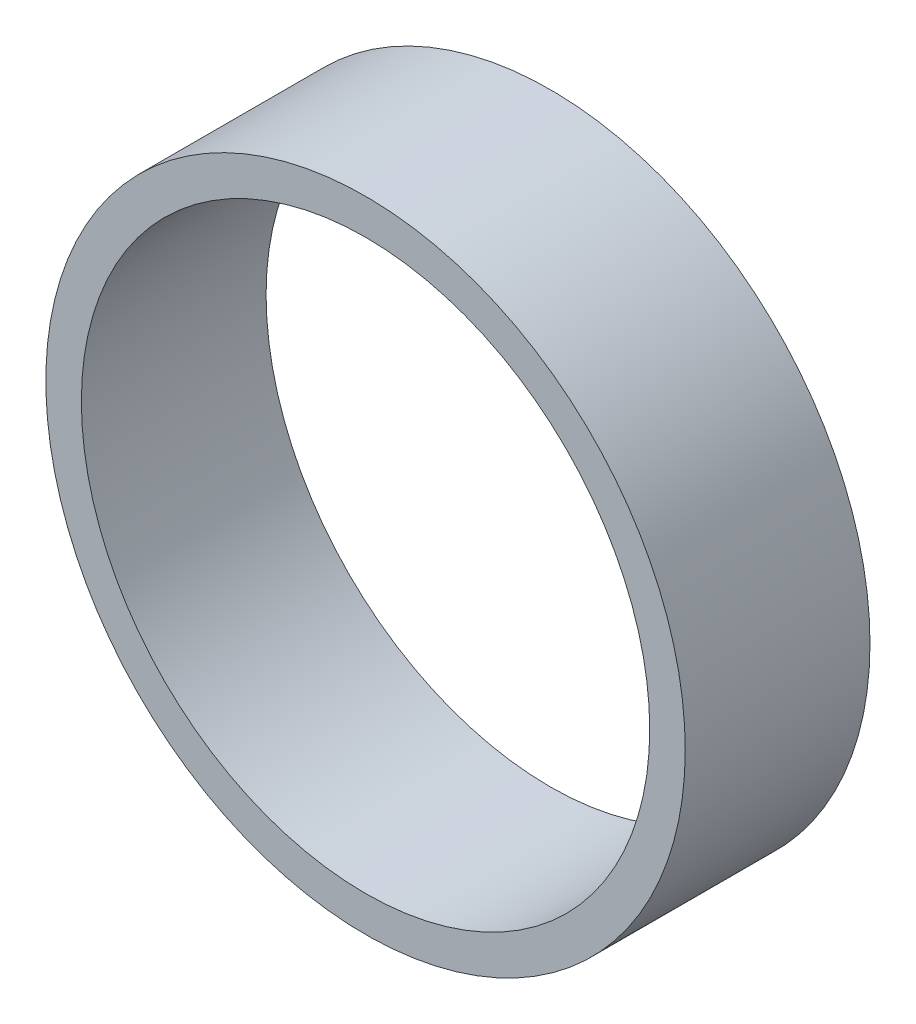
ISO-10303-21;
HEADER;
FILE_DESCRIPTION(('STEP AP214'),'2;1');
FILE_NAME('part.step','',(''),(''),'','','');
FILE_SCHEMA(('AUTOMOTIVE_DESIGN { 1 0 10303 214 1 1 1 1 }'));
ENDSEC;
DATA;
#1=APPLICATION_CONTEXT('core data for automotive mechanical design processes');
#2=APPLICATION_PROTOCOL_DEFINITION('international standard','automotive_design',2000,#1);
#3=PRODUCT_CONTEXT('',#1,'mechanical');
#4=PRODUCT('Part','Part','',(#3));
#5=PRODUCT_RELATED_PRODUCT_CATEGORY('part','',(#4));
#6=PRODUCT_DEFINITION_FORMATION('','',#4);
#7=PRODUCT_DEFINITION_CONTEXT('part definition',#1,'design');
#8=PRODUCT_DEFINITION('design','',#6,#7);
#9=PRODUCT_DEFINITION_SHAPE('','',#8);
#10=(LENGTH_UNIT() NAMED_UNIT(*) SI_UNIT(.MILLI.,.METRE.));
#11=(NAMED_UNIT(*) PLANE_ANGLE_UNIT() SI_UNIT($,.RADIAN.));
#12=(NAMED_UNIT(*) SI_UNIT($,.STERADIAN.) SOLID_ANGLE_UNIT());
#13=UNCERTAINTY_MEASURE_WITH_UNIT(LENGTH_MEASURE(1.E-05),#10,'distance_accuracy_value','');
#14=(GEOMETRIC_REPRESENTATION_CONTEXT(3) GLOBAL_UNCERTAINTY_ASSIGNED_CONTEXT((#13)) GLOBAL_UNIT_ASSIGNED_CONTEXT((#10,
#11,#12)) REPRESENTATION_CONTEXT('',''));
#15=CARTESIAN_POINT('',(0.,0.,0.));
#16=DIRECTION('',(0.,0.,1.));
#17=DIRECTION('',(1.,0.,0.));
#18=AXIS2_PLACEMENT_3D('',#15,#16,#17);
#19=CARTESIAN_POINT('',(-2.22044604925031E-13,0.,-12.9999999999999));
#20=DIRECTION('',(0.,0.,1.));
#21=DIRECTION('',(1.00000000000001,0.,0.));
#22=AXIS2_PLACEMENT_3D('',#19,#20,#21);
#23=CYLINDRICAL_SURFACE('',#22,22.5);
#24=CARTESIAN_POINT('',(-2.22044604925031E-13,0.,-12.9999999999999));
#25=DIRECTION('',(0.,0.,1.));
#26=DIRECTION('',(1.00000000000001,0.,0.));
#27=AXIS2_PLACEMENT_3D('',#24,#25,#26);
#28=CIRCLE('',#27,22.5);
#29=CARTESIAN_POINT('',(22.5,0.,-12.9999999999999));
#30=VERTEX_POINT('',#29);
#31=EDGE_CURVE('E11',#30,#30,#28,.T.);
#32=CARTESIAN_POINT('',(-2.77555756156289E-13,0.,1.2490009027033E-13));
#33=DIRECTION('',(0.,0.,1.));
#34=DIRECTION('',(1.00000000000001,0.,0.));
#35=AXIS2_PLACEMENT_3D('',#32,#33,#34);
#36=CIRCLE('',#35,22.5);
#37=CARTESIAN_POINT('',(22.5,0.,1.26634813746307E-13));
#38=VERTEX_POINT('',#37);
#39=EDGE_CURVE('E49',#38,#38,#36,.T.);
#40=CARTESIAN_POINT('',(22.5,0.,-12.9999999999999));
#41=CARTESIAN_POINT('',(22.5,0.,-12.8645833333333));
#42=CARTESIAN_POINT('',(22.5,0.,-12.7291666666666));
#43=CARTESIAN_POINT('',(22.5,0.,-12.4583333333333));
#44=CARTESIAN_POINT('',(22.5,0.,-12.3229166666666));
#45=CARTESIAN_POINT('',(22.5,0.,-12.0520833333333));
#46=CARTESIAN_POINT('',(22.5,0.,-11.9166666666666));
#47=CARTESIAN_POINT('',(22.5,0.,-11.6458333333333));
#48=CARTESIAN_POINT('',(22.5,0.,-11.5104166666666));
#49=CARTESIAN_POINT('',(22.5,0.,-11.2395833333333));
#50=CARTESIAN_POINT('',(22.5,0.,-11.1041666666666));
#51=CARTESIAN_POINT('',(22.5,0.,-10.8333333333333));
#52=CARTESIAN_POINT('',(22.5,0.,-10.6979166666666));
#53=CARTESIAN_POINT('',(22.5,0.,-10.4270833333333));
#54=CARTESIAN_POINT('',(22.5,0.,-10.2916666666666));
#55=CARTESIAN_POINT('',(22.5,0.,-10.0208333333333));
#56=CARTESIAN_POINT('',(22.5,0.,-9.88541666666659));
#57=CARTESIAN_POINT('',(22.5,0.,-9.61458333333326));
#58=CARTESIAN_POINT('',(22.5,0.,-9.47916666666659));
#59=CARTESIAN_POINT('',(22.5,0.,-9.20833333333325));
#60=CARTESIAN_POINT('',(22.5,0.,-9.07291666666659));
#61=CARTESIAN_POINT('',(22.5,0.,-8.80208333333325));
#62=CARTESIAN_POINT('',(22.5,0.,-8.66666666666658));
#63=CARTESIAN_POINT('',(22.5,0.,-8.39583333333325));
#64=CARTESIAN_POINT('',(22.5,0.,-8.26041666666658));
#65=CARTESIAN_POINT('',(22.5,0.,-7.98958333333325));
#66=CARTESIAN_POINT('',(22.5,0.,-7.85416666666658));
#67=CARTESIAN_POINT('',(22.5,0.,-7.58333333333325));
#68=CARTESIAN_POINT('',(22.5,0.,-7.44791666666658));
#69=CARTESIAN_POINT('',(22.5,0.,-7.17708333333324));
#70=CARTESIAN_POINT('',(22.5,0.,-7.04166666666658));
#71=CARTESIAN_POINT('',(22.5,0.,-6.77083333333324));
#72=CARTESIAN_POINT('',(22.5,0.,-6.63541666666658));
#73=CARTESIAN_POINT('',(22.5,0.,-6.36458333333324));
#74=CARTESIAN_POINT('',(22.5,0.,-6.22916666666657));
#75=CARTESIAN_POINT('',(22.5,0.,-5.95833333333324));
#76=CARTESIAN_POINT('',(22.5,0.,-5.82291666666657));
#77=CARTESIAN_POINT('',(22.5,0.,-5.55208333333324));
#78=CARTESIAN_POINT('',(22.5,0.,-5.41666666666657));
#79=CARTESIAN_POINT('',(22.5,0.,-5.14583333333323));
#80=CARTESIAN_POINT('',(22.5,0.,-5.01041666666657));
#81=CARTESIAN_POINT('',(22.5,0.,-4.73958333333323));
#82=CARTESIAN_POINT('',(22.5,0.,-4.60416666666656));
#83=CARTESIAN_POINT('',(22.5,0.,-4.33333333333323));
#84=CARTESIAN_POINT('',(22.5,0.,-4.19791666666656));
#85=CARTESIAN_POINT('',(22.5,0.,-3.92708333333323));
#86=CARTESIAN_POINT('',(22.5,0.,-3.79166666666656));
#87=CARTESIAN_POINT('',(22.5,0.,-3.52083333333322));
#88=CARTESIAN_POINT('',(22.5,0.,-3.38541666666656));
#89=CARTESIAN_POINT('',(22.5,0.,-3.11458333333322));
#90=CARTESIAN_POINT('',(22.5,0.,-2.97916666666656));
#91=CARTESIAN_POINT('',(22.5,0.,-2.70833333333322));
#92=CARTESIAN_POINT('',(22.5,0.,-2.57291666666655));
#93=CARTESIAN_POINT('',(22.5,0.,-2.30208333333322));
#94=CARTESIAN_POINT('',(22.5,0.,-2.16666666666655));
#95=CARTESIAN_POINT('',(22.5,0.,-1.89583333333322));
#96=CARTESIAN_POINT('',(22.5,0.,-1.76041666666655));
#97=CARTESIAN_POINT('',(22.5,0.,-1.48958333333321));
#98=CARTESIAN_POINT('',(22.5,0.,-1.35416666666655));
#99=CARTESIAN_POINT('',(22.5,0.,-1.08333333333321));
#100=CARTESIAN_POINT('',(22.5,0.,-0.947916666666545));
#101=CARTESIAN_POINT('',(22.5,0.,-0.67708333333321));
#102=CARTESIAN_POINT('',(22.5,0.,-0.541666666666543));
#103=CARTESIAN_POINT('',(22.5,0.,-0.270833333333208));
#104=CARTESIAN_POINT('',(22.5,0.,-0.135416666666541));
#105=CARTESIAN_POINT('',(22.5,0.,1.26634813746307E-13));
#106=B_SPLINE_CURVE_WITH_KNOTS('',3,(#40,#41,#42,#43,#44,#45,#46,#47,#48,#49,#50,#51,#52,#53,
#54,#55,#56,#57,#58,#59,#60,#61,#62,#63,#64,#65,#66,#67,#68,#69,#70,#71,#72,#73,#74,#75,#76,#77,
#78,#79,#80,#81,#82,#83,#84,#85,#86,#87,#88,#89,#90,#91,#92,#93,#94,#95,#96,#97,#98,#99,#100,
#101,#102,#103,#104,#105),.UNSPECIFIED.,.F.,.F.,(4,2,2,2,2,2,2,2,2,2,2,2,2,2,2,2,2,2,2,2,2,2,2,
2,2,2,2,2,2,2,2,2,4),(0.,0.406250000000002,0.812500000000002,1.21875000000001,1.62500000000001,
2.03125000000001,2.43750000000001,2.84375000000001,3.25000000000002,3.65625000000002,
4.06250000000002,4.46875000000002,4.87500000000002,5.28125000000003,5.68750000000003,
6.09375000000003,6.50000000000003,6.90625000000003,7.31250000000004,7.71875000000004,
8.12500000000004,8.53125000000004,8.93750000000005,9.34375000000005,9.75000000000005,
10.1562500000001,10.5625000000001,10.9687500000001,11.3750000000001,11.7812500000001,
12.1875000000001,12.5937500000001,13.0000000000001),.UNSPECIFIED.);
#107=EDGE_CURVE('BSEAM42',#30,#38,#106,.T.);
#108=ORIENTED_EDGE('',*,*,#31,.T.);
#109=ORIENTED_EDGE('',*,*,#39,.F.);
#110=ORIENTED_EDGE('',*,*,#107,.T.);
#111=ORIENTED_EDGE('',*,*,#107,.F.);
#112=EDGE_LOOP('',(#108,#110,#109,#111));
#113=FACE_BOUND('',#112,.T.);
#114=ADVANCED_FACE('F42',(#113),#23,.T.);
#115=CARTESIAN_POINT('',(-2.22044604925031E-13,0.,-12.9999999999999));
#116=DIRECTION('',(0.,0.,1.));
#117=DIRECTION('',(1.00000000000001,0.,0.));
#118=AXIS2_PLACEMENT_3D('',#115,#116,#117);
#119=PLANE('',#118);
#120=CARTESIAN_POINT('',(-2.22044604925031E-13,0.,-12.9999999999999));
#121=DIRECTION('',(0.,0.,1.));
#122=DIRECTION('',(1.00000000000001,0.,0.));
#123=AXIS2_PLACEMENT_3D('',#120,#121,#122);
#124=CIRCLE('',#123,20.);
#125=CARTESIAN_POINT('',(20.,0.,-12.9999999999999));
#126=VERTEX_POINT('',#125);
#127=EDGE_CURVE('E55',#126,#126,#124,.T.);
#128=ORIENTED_EDGE('',*,*,#127,.T.);
#129=EDGE_LOOP('',(#128));
#130=FACE_BOUND('',#129,.T.);
#131=ORIENTED_EDGE('',*,*,#31,.F.);
#132=EDGE_LOOP('',(#131));
#133=FACE_BOUND('',#132,.T.);
#134=ADVANCED_FACE('F70',(#130,#133),#119,.F.);
#135=CARTESIAN_POINT('',(-2.77555756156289E-13,0.,1.2490009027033E-13));
#136=DIRECTION('',(0.,0.,1.));
#137=DIRECTION('',(1.00000000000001,0.,0.));
#138=AXIS2_PLACEMENT_3D('',#135,#136,#137);
#139=PLANE('',#138);
#140=CARTESIAN_POINT('',(-2.77555756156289E-13,0.,1.2490009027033E-13));
#141=DIRECTION('',(0.,0.,1.));
#142=DIRECTION('',(1.00000000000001,0.,0.));
#143=AXIS2_PLACEMENT_3D('',#140,#141,#142);
#144=CIRCLE('',#143,20.);
#145=CARTESIAN_POINT('',(20.,0.,1.26634813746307E-13));
#146=VERTEX_POINT('',#145);
#147=EDGE_CURVE('E60',#146,#146,#144,.T.);
#148=ORIENTED_EDGE('',*,*,#147,.F.);
#149=EDGE_LOOP('',(#148));
#150=FACE_BOUND('',#149,.T.);
#151=ORIENTED_EDGE('',*,*,#39,.T.);
#152=EDGE_LOOP('',(#151));
#153=FACE_BOUND('',#152,.T.);
#154=ADVANCED_FACE('F68',(#150,#153),#139,.T.);
#155=CARTESIAN_POINT('',(-2.22044604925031E-13,0.,-12.9999999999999));
#156=DIRECTION('',(0.,0.,1.));
#157=DIRECTION('',(1.00000000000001,0.,0.));
#158=AXIS2_PLACEMENT_3D('',#155,#156,#157);
#159=CYLINDRICAL_SURFACE('',#158,20.);
#160=CARTESIAN_POINT('',(20.,0.,-12.9999999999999));
#161=CARTESIAN_POINT('',(20.,0.,-12.8645833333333));
#162=CARTESIAN_POINT('',(20.,0.,-12.7291666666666));
#163=CARTESIAN_POINT('',(20.,0.,-12.4583333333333));
#164=CARTESIAN_POINT('',(20.,0.,-12.3229166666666));
#165=CARTESIAN_POINT('',(20.,0.,-12.0520833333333));
#166=CARTESIAN_POINT('',(20.,0.,-11.9166666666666));
#167=CARTESIAN_POINT('',(20.,0.,-11.6458333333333));
#168=CARTESIAN_POINT('',(20.,0.,-11.5104166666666));
#169=CARTESIAN_POINT('',(20.,0.,-11.2395833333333));
#170=CARTESIAN_POINT('',(20.,0.,-11.1041666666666));
#171=CARTESIAN_POINT('',(20.,0.,-10.8333333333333));
#172=CARTESIAN_POINT('',(20.,0.,-10.6979166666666));
#173=CARTESIAN_POINT('',(20.,0.,-10.4270833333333));
#174=CARTESIAN_POINT('',(20.,0.,-10.2916666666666));
#175=CARTESIAN_POINT('',(20.,0.,-10.0208333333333));
#176=CARTESIAN_POINT('',(20.,0.,-9.88541666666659));
#177=CARTESIAN_POINT('',(20.,0.,-9.61458333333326));
#178=CARTESIAN_POINT('',(20.,0.,-9.47916666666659));
#179=CARTESIAN_POINT('',(20.,0.,-9.20833333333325));
#180=CARTESIAN_POINT('',(20.,0.,-9.07291666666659));
#181=CARTESIAN_POINT('',(20.,0.,-8.80208333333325));
#182=CARTESIAN_POINT('',(20.,0.,-8.66666666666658));
#183=CARTESIAN_POINT('',(20.,0.,-8.39583333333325));
#184=CARTESIAN_POINT('',(20.,0.,-8.26041666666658));
#185=CARTESIAN_POINT('',(20.,0.,-7.98958333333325));
#186=CARTESIAN_POINT('',(20.,0.,-7.85416666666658));
#187=CARTESIAN_POINT('',(20.,0.,-7.58333333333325));
#188=CARTESIAN_POINT('',(20.,0.,-7.44791666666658));
#189=CARTESIAN_POINT('',(20.,0.,-7.17708333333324));
#190=CARTESIAN_POINT('',(20.,0.,-7.04166666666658));
#191=CARTESIAN_POINT('',(20.,0.,-6.77083333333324));
#192=CARTESIAN_POINT('',(20.,0.,-6.63541666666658));
#193=CARTESIAN_POINT('',(20.,0.,-6.36458333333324));
#194=CARTESIAN_POINT('',(20.,0.,-6.22916666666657));
#195=CARTESIAN_POINT('',(20.,0.,-5.95833333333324));
#196=CARTESIAN_POINT('',(20.,0.,-5.82291666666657));
#197=CARTESIAN_POINT('',(20.,0.,-5.55208333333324));
#198=CARTESIAN_POINT('',(20.,0.,-5.41666666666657));
#199=CARTESIAN_POINT('',(20.,0.,-5.14583333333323));
#200=CARTESIAN_POINT('',(20.,0.,-5.01041666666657));
#201=CARTESIAN_POINT('',(20.,0.,-4.73958333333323));
#202=CARTESIAN_POINT('',(20.,0.,-4.60416666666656));
#203=CARTESIAN_POINT('',(20.,0.,-4.33333333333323));
#204=CARTESIAN_POINT('',(20.,0.,-4.19791666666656));
#205=CARTESIAN_POINT('',(20.,0.,-3.92708333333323));
#206=CARTESIAN_POINT('',(20.,0.,-3.79166666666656));
#207=CARTESIAN_POINT('',(20.,0.,-3.52083333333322));
#208=CARTESIAN_POINT('',(20.,0.,-3.38541666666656));
#209=CARTESIAN_POINT('',(20.,0.,-3.11458333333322));
#210=CARTESIAN_POINT('',(20.,0.,-2.97916666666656));
#211=CARTESIAN_POINT('',(20.,0.,-2.70833333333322));
#212=CARTESIAN_POINT('',(20.,0.,-2.57291666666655));
#213=CARTESIAN_POINT('',(20.,0.,-2.30208333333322));
#214=CARTESIAN_POINT('',(20.,0.,-2.16666666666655));
#215=CARTESIAN_POINT('',(20.,0.,-1.89583333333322));
#216=CARTESIAN_POINT('',(20.,0.,-1.76041666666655));
#217=CARTESIAN_POINT('',(20.,0.,-1.48958333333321));
#218=CARTESIAN_POINT('',(20.,0.,-1.35416666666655));
#219=CARTESIAN_POINT('',(20.,0.,-1.08333333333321));
#220=CARTESIAN_POINT('',(20.,0.,-0.947916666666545));
#221=CARTESIAN_POINT('',(20.,0.,-0.67708333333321));
#222=CARTESIAN_POINT('',(20.,0.,-0.541666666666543));
#223=CARTESIAN_POINT('',(20.,0.,-0.270833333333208));
#224=CARTESIAN_POINT('',(20.,0.,-0.135416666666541));
#225=CARTESIAN_POINT('',(20.,0.,1.26634813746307E-13));
#226=B_SPLINE_CURVE_WITH_KNOTS('',3,(#160,#161,#162,#163,#164,#165,#166,#167,#168,#169,#170,
#171,#172,#173,#174,#175,#176,#177,#178,#179,#180,#181,#182,#183,#184,#185,#186,#187,#188,#189,
#190,#191,#192,#193,#194,#195,#196,#197,#198,#199,#200,#201,#202,#203,#204,#205,#206,#207,#208,
#209,#210,#211,#212,#213,#214,#215,#216,#217,#218,#219,#220,#221,#222,#223,#224,#225),
.UNSPECIFIED.,.F.,.F.,(4,2,2,2,2,2,2,2,2,2,2,2,2,2,2,2,2,2,2,2,2,2,2,2,2,2,2,2,2,2,2,2,4),(0.,
0.406250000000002,0.812500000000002,1.21875000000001,1.62500000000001,2.03125000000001,
2.43750000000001,2.84375000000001,3.25000000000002,3.65625000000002,4.06250000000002,
4.46875000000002,4.87500000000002,5.28125000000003,5.68750000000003,6.09375000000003,
6.50000000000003,6.90625000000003,7.31250000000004,7.71875000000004,8.12500000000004,
8.53125000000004,8.93750000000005,9.34375000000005,9.75000000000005,10.1562500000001,
10.5625000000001,10.9687500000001,11.3750000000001,11.7812500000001,12.1875000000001,
12.5937500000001,13.0000000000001),.UNSPECIFIED.);
#227=EDGE_CURVE('BSEAM66',#126,#146,#226,.T.);
#228=ORIENTED_EDGE('',*,*,#127,.F.);
#229=ORIENTED_EDGE('',*,*,#147,.T.);
#230=ORIENTED_EDGE('',*,*,#227,.T.);
#231=ORIENTED_EDGE('',*,*,#227,.F.);
#232=EDGE_LOOP('',(#228,#230,#229,#231));
#233=FACE_BOUND('',#232,.T.);
#234=ADVANCED_FACE('F66',(#233),#159,.F.);
#235=CLOSED_SHELL('',(#114,#134,#154,#234));
#236=MANIFOLD_SOLID_BREP('B2',#235);
#237=ADVANCED_BREP_SHAPE_REPRESENTATION('',(#18,#236),#14);
#238=SHAPE_DEFINITION_REPRESENTATION(#9,#237);
ENDSEC;
END-ISO-10303-21;
